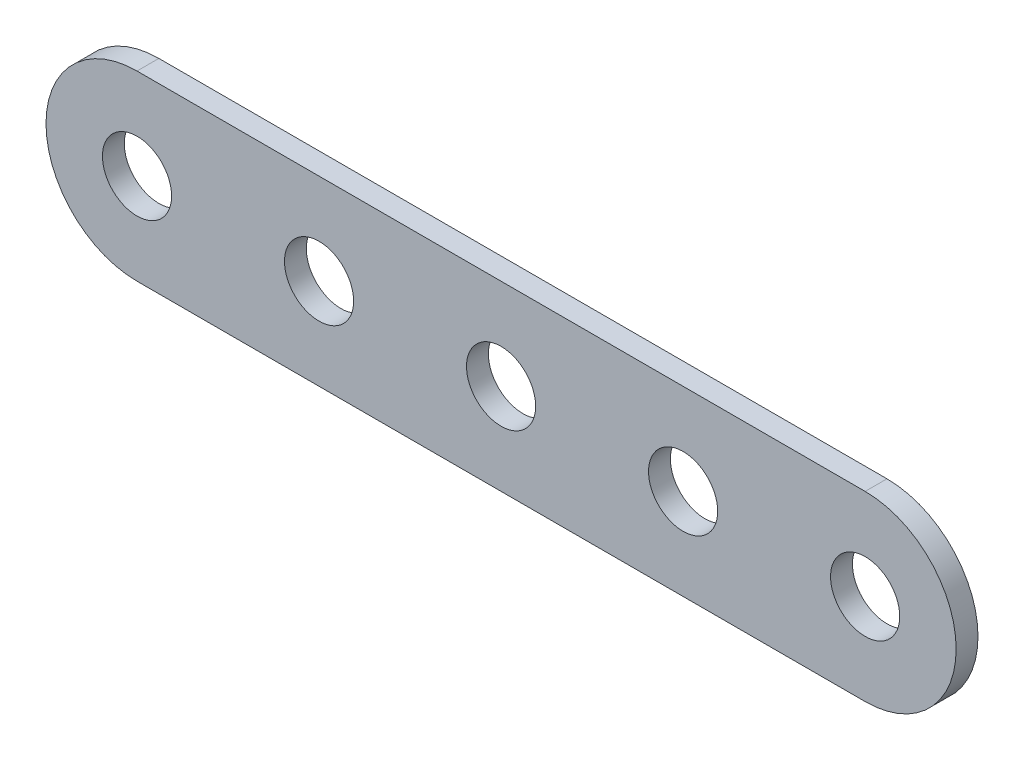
ISO-10303-21;
HEADER;
FILE_DESCRIPTION(('STEP AP214'),'2;1');
FILE_NAME('part.step','',(''),(''),'','','');
FILE_SCHEMA(('AUTOMOTIVE_DESIGN { 1 0 10303 214 1 1 1 1 }'));
ENDSEC;
DATA;
#1=APPLICATION_CONTEXT('core data for automotive mechanical design processes');
#2=APPLICATION_PROTOCOL_DEFINITION('international standard','automotive_design',2000,#1);
#3=PRODUCT_CONTEXT('',#1,'mechanical');
#4=PRODUCT('Part','Part','',(#3));
#5=PRODUCT_RELATED_PRODUCT_CATEGORY('part','',(#4));
#6=PRODUCT_DEFINITION_FORMATION('','',#4);
#7=PRODUCT_DEFINITION_CONTEXT('part definition',#1,'design');
#8=PRODUCT_DEFINITION('design','',#6,#7);
#9=PRODUCT_DEFINITION_SHAPE('','',#8);
#10=(LENGTH_UNIT() NAMED_UNIT(*) SI_UNIT(.MILLI.,.METRE.));
#11=(NAMED_UNIT(*) PLANE_ANGLE_UNIT() SI_UNIT($,.RADIAN.));
#12=(NAMED_UNIT(*) SI_UNIT($,.STERADIAN.) SOLID_ANGLE_UNIT());
#13=UNCERTAINTY_MEASURE_WITH_UNIT(LENGTH_MEASURE(1.E-05),#10,'distance_accuracy_value','');
#14=(GEOMETRIC_REPRESENTATION_CONTEXT(3) GLOBAL_UNCERTAINTY_ASSIGNED_CONTEXT((#13)) GLOBAL_UNIT_ASSIGNED_CONTEXT((#10,
#11,#12)) REPRESENTATION_CONTEXT('',''));
#15=CARTESIAN_POINT('',(0.,0.,0.));
#16=DIRECTION('',(0.,0.,1.));
#17=DIRECTION('',(1.,0.,0.));
#18=AXIS2_PLACEMENT_3D('',#15,#16,#17);
#19=CARTESIAN_POINT('',(-25.4,0.,1.524));
#20=DIRECTION('',(0.,0.,-1.));
#21=DIRECTION('',(-1.,0.,0.));
#22=AXIS2_PLACEMENT_3D('',#19,#20,#21);
#23=CYLINDRICAL_SURFACE('',#22,6.35);
#24=CARTESIAN_POINT('',(-25.4,0.,0.));
#25=DIRECTION('',(0.,0.,1.));
#26=DIRECTION('',(1.,0.,0.));
#27=AXIS2_PLACEMENT_3D('',#24,#25,#26);
#28=CIRCLE('',#27,6.35);
#29=CARTESIAN_POINT('',(-25.4,6.35,0.));
#30=VERTEX_POINT('',#29);
#31=CARTESIAN_POINT('',(-25.4,-6.35,0.));
#32=VERTEX_POINT('',#31);
#33=EDGE_CURVE('E101',#30,#32,#28,.T.);
#34=ORIENTED_EDGE('',*,*,#33,.T.);
#35=DIRECTION('',(0.,0.,-1.));
#36=VECTOR('',#35,1.);
#37=CARTESIAN_POINT('',(-25.4,-6.35,1.524));
#38=LINE('',#37,#36);
#39=CARTESIAN_POINT('',(-25.4,-6.35,1.524));
#40=VERTEX_POINT('',#39);
#41=EDGE_CURVE('E11',#40,#32,#38,.T.);
#42=ORIENTED_EDGE('',*,*,#41,.F.);
#43=CARTESIAN_POINT('',(-25.4,0.,1.524));
#44=DIRECTION('',(0.,0.,1.));
#45=DIRECTION('',(1.,0.,0.));
#46=AXIS2_PLACEMENT_3D('',#43,#44,#45);
#47=CIRCLE('',#46,6.35);
#48=CARTESIAN_POINT('',(-25.4,6.35,1.524));
#49=VERTEX_POINT('',#48);
#50=EDGE_CURVE('E89',#49,#40,#47,.T.);
#51=ORIENTED_EDGE('',*,*,#50,.F.);
#52=DIRECTION('',(0.,0.,-1.));
#53=VECTOR('',#52,1.);
#54=CARTESIAN_POINT('',(-25.4,6.35,1.524));
#55=LINE('',#54,#53);
#56=EDGE_CURVE('E97',#49,#30,#55,.T.);
#57=ORIENTED_EDGE('',*,*,#56,.T.);
#58=EDGE_LOOP('',(#34,#42,#51,#57));
#59=FACE_BOUND('',#58,.T.);
#60=ADVANCED_FACE('F38',(#59),#23,.T.);
#61=CARTESIAN_POINT('',(-25.4,-6.35,1.524));
#62=DIRECTION('',(0.,1.,0.));
#63=DIRECTION('',(0.,0.,1.));
#64=AXIS2_PLACEMENT_3D('',#61,#62,#63);
#65=PLANE('',#64);
#66=DIRECTION('',(1.,0.,0.));
#67=VECTOR('',#66,1.);
#68=CARTESIAN_POINT('',(-25.4,-6.35,0.));
#69=LINE('',#68,#67);
#70=CARTESIAN_POINT('',(25.4,-6.35,0.));
#71=VERTEX_POINT('',#70);
#72=EDGE_CURVE('E93',#32,#71,#69,.T.);
#73=ORIENTED_EDGE('',*,*,#72,.T.);
#74=DIRECTION('',(0.,0.,-1.));
#75=VECTOR('',#74,1.);
#76=CARTESIAN_POINT('',(25.4,-6.35,1.524));
#77=LINE('',#76,#75);
#78=CARTESIAN_POINT('',(25.4,-6.35,1.524));
#79=VERTEX_POINT('',#78);
#80=EDGE_CURVE('E46',#79,#71,#77,.T.);
#81=ORIENTED_EDGE('',*,*,#80,.F.);
#82=DIRECTION('',(1.,0.,0.));
#83=VECTOR('',#82,1.);
#84=CARTESIAN_POINT('',(-25.4,-6.35,1.524));
#85=LINE('',#84,#83);
#86=EDGE_CURVE('E84',#40,#79,#85,.T.);
#87=ORIENTED_EDGE('',*,*,#86,.F.);
#88=ORIENTED_EDGE('',*,*,#41,.T.);
#89=EDGE_LOOP('',(#73,#81,#87,#88));
#90=FACE_BOUND('',#89,.T.);
#91=ADVANCED_FACE('F92',(#90),#65,.F.);
#92=CARTESIAN_POINT('',(25.4,0.,1.524));
#93=DIRECTION('',(0.,0.,-1.));
#94=DIRECTION('',(-1.,0.,0.));
#95=AXIS2_PLACEMENT_3D('',#92,#93,#94);
#96=CYLINDRICAL_SURFACE('',#95,6.35);
#97=CARTESIAN_POINT('',(25.4,0.,0.));
#98=DIRECTION('',(0.,0.,1.));
#99=DIRECTION('',(-1.,0.,0.));
#100=AXIS2_PLACEMENT_3D('',#97,#98,#99);
#101=CIRCLE('',#100,6.35);
#102=CARTESIAN_POINT('',(25.4,6.35,0.));
#103=VERTEX_POINT('',#102);
#104=EDGE_CURVE('E71',#71,#103,#101,.T.);
#105=ORIENTED_EDGE('',*,*,#104,.T.);
#106=DIRECTION('',(0.,0.,-1.));
#107=VECTOR('',#106,1.);
#108=CARTESIAN_POINT('',(25.4,6.35,1.524));
#109=LINE('',#108,#107);
#110=CARTESIAN_POINT('',(25.4,6.35,1.524));
#111=VERTEX_POINT('',#110);
#112=EDGE_CURVE('E94',#111,#103,#109,.T.);
#113=ORIENTED_EDGE('',*,*,#112,.F.);
#114=CARTESIAN_POINT('',(25.4,0.,1.524));
#115=DIRECTION('',(0.,0.,1.));
#116=DIRECTION('',(-1.,0.,0.));
#117=AXIS2_PLACEMENT_3D('',#114,#115,#116);
#118=CIRCLE('',#117,6.35);
#119=EDGE_CURVE('E87',#79,#111,#118,.T.);
#120=ORIENTED_EDGE('',*,*,#119,.F.);
#121=ORIENTED_EDGE('',*,*,#80,.T.);
#122=EDGE_LOOP('',(#105,#113,#120,#121));
#123=FACE_BOUND('',#122,.T.);
#124=ADVANCED_FACE('F95',(#123),#96,.T.);
#125=CARTESIAN_POINT('',(-25.4,6.35,1.524));
#126=DIRECTION('',(0.,-1.,0.));
#127=DIRECTION('',(0.,0.,-1.));
#128=AXIS2_PLACEMENT_3D('',#125,#126,#127);
#129=PLANE('',#128);
#130=DIRECTION('',(-1.,0.,0.));
#131=VECTOR('',#130,1.);
#132=CARTESIAN_POINT('',(-25.4,6.35,0.));
#133=LINE('',#132,#131);
#134=EDGE_CURVE('E77',#103,#30,#133,.T.);
#135=ORIENTED_EDGE('',*,*,#134,.T.);
#136=ORIENTED_EDGE('',*,*,#56,.F.);
#137=DIRECTION('',(-1.,0.,0.));
#138=VECTOR('',#137,1.);
#139=CARTESIAN_POINT('',(-25.4,6.35,1.524));
#140=LINE('',#139,#138);
#141=EDGE_CURVE('E54',#111,#49,#140,.T.);
#142=ORIENTED_EDGE('',*,*,#141,.F.);
#143=ORIENTED_EDGE('',*,*,#112,.T.);
#144=EDGE_LOOP('',(#135,#136,#142,#143));
#145=FACE_BOUND('',#144,.T.);
#146=ADVANCED_FACE('F109',(#145),#129,.F.);
#147=CARTESIAN_POINT('',(-25.4,0.,1.524));
#148=DIRECTION('',(0.,0.,1.));
#149=DIRECTION('',(1.,0.,0.));
#150=AXIS2_PLACEMENT_3D('',#147,#148,#149);
#151=PLANE('',#150);
#152=CARTESIAN_POINT('',(25.4,0.,1.524));
#153=DIRECTION('',(0.,0.,1.));
#154=DIRECTION('',(1.,0.,0.));
#155=AXIS2_PLACEMENT_3D('',#152,#153,#154);
#156=CIRCLE('',#155,2.41299999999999);
#157=CARTESIAN_POINT('',(27.813,0.,1.524));
#158=VERTEX_POINT('',#157);
#159=EDGE_CURVE('E138',#158,#158,#156,.T.);
#160=ORIENTED_EDGE('',*,*,#159,.F.);
#161=EDGE_LOOP('',(#160));
#162=FACE_BOUND('',#161,.T.);
#163=CARTESIAN_POINT('',(12.7,0.,1.524));
#164=DIRECTION('',(0.,0.,1.));
#165=DIRECTION('',(1.,0.,0.));
#166=AXIS2_PLACEMENT_3D('',#163,#164,#165);
#167=CIRCLE('',#166,2.41299999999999);
#168=CARTESIAN_POINT('',(15.113,0.,1.524));
#169=VERTEX_POINT('',#168);
#170=EDGE_CURVE('E132',#169,#169,#167,.T.);
#171=ORIENTED_EDGE('',*,*,#170,.F.);
#172=EDGE_LOOP('',(#171));
#173=FACE_BOUND('',#172,.T.);
#174=CARTESIAN_POINT('',(0.,0.,1.524));
#175=DIRECTION('',(0.,0.,1.));
#176=DIRECTION('',(1.,0.,0.));
#177=AXIS2_PLACEMENT_3D('',#174,#175,#176);
#178=CIRCLE('',#177,2.41299999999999);
#179=CARTESIAN_POINT('',(2.41299999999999,0.,1.524));
#180=VERTEX_POINT('',#179);
#181=EDGE_CURVE('E126',#180,#180,#178,.T.);
#182=ORIENTED_EDGE('',*,*,#181,.F.);
#183=EDGE_LOOP('',(#182));
#184=FACE_BOUND('',#183,.T.);
#185=CARTESIAN_POINT('',(-12.7,0.,1.524));
#186=DIRECTION('',(0.,0.,1.));
#187=DIRECTION('',(1.,0.,0.));
#188=AXIS2_PLACEMENT_3D('',#185,#186,#187);
#189=CIRCLE('',#188,2.41299999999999);
#190=CARTESIAN_POINT('',(-10.287,0.,1.524));
#191=VERTEX_POINT('',#190);
#192=EDGE_CURVE('E118',#191,#191,#189,.T.);
#193=ORIENTED_EDGE('',*,*,#192,.F.);
#194=EDGE_LOOP('',(#193));
#195=FACE_BOUND('',#194,.T.);
#196=CARTESIAN_POINT('',(-25.4,0.,1.524));
#197=DIRECTION('',(0.,0.,1.));
#198=DIRECTION('',(1.,0.,0.));
#199=AXIS2_PLACEMENT_3D('',#196,#197,#198);
#200=CIRCLE('',#199,2.41299999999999);
#201=CARTESIAN_POINT('',(-22.987,0.,1.524));
#202=VERTEX_POINT('',#201);
#203=EDGE_CURVE('E115',#202,#202,#200,.T.);
#204=ORIENTED_EDGE('',*,*,#203,.F.);
#205=EDGE_LOOP('',(#204));
#206=FACE_BOUND('',#205,.T.);
#207=ORIENTED_EDGE('',*,*,#50,.T.);
#208=ORIENTED_EDGE('',*,*,#86,.T.);
#209=ORIENTED_EDGE('',*,*,#119,.T.);
#210=ORIENTED_EDGE('',*,*,#141,.T.);
#211=EDGE_LOOP('',(#207,#208,#209,#210));
#212=FACE_BOUND('',#211,.T.);
#213=ADVANCED_FACE('F85',(#162,#173,#184,#195,#206,#212),#151,.T.);
#214=CARTESIAN_POINT('',(-25.4,0.,0.));
#215=DIRECTION('',(0.,0.,1.));
#216=DIRECTION('',(1.,0.,0.));
#217=AXIS2_PLACEMENT_3D('',#214,#215,#216);
#218=PLANE('',#217);
#219=CARTESIAN_POINT('',(25.4,0.,0.));
#220=DIRECTION('',(0.,0.,1.));
#221=DIRECTION('',(1.,0.,0.));
#222=AXIS2_PLACEMENT_3D('',#219,#220,#221);
#223=CIRCLE('',#222,2.41299999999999);
#224=CARTESIAN_POINT('',(27.813,0.,0.));
#225=VERTEX_POINT('',#224);
#226=EDGE_CURVE('E141',#225,#225,#223,.T.);
#227=ORIENTED_EDGE('',*,*,#226,.T.);
#228=EDGE_LOOP('',(#227));
#229=FACE_BOUND('',#228,.T.);
#230=CARTESIAN_POINT('',(12.7,0.,0.));
#231=DIRECTION('',(0.,0.,1.));
#232=DIRECTION('',(1.,0.,0.));
#233=AXIS2_PLACEMENT_3D('',#230,#231,#232);
#234=CIRCLE('',#233,2.41299999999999);
#235=CARTESIAN_POINT('',(15.113,0.,0.));
#236=VERTEX_POINT('',#235);
#237=EDGE_CURVE('E135',#236,#236,#234,.T.);
#238=ORIENTED_EDGE('',*,*,#237,.T.);
#239=EDGE_LOOP('',(#238));
#240=FACE_BOUND('',#239,.T.);
#241=CARTESIAN_POINT('',(0.,0.,0.));
#242=DIRECTION('',(0.,0.,1.));
#243=DIRECTION('',(1.,0.,0.));
#244=AXIS2_PLACEMENT_3D('',#241,#242,#243);
#245=CIRCLE('',#244,2.41299999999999);
#246=CARTESIAN_POINT('',(2.41299999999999,0.,0.));
#247=VERTEX_POINT('',#246);
#248=EDGE_CURVE('E129',#247,#247,#245,.T.);
#249=ORIENTED_EDGE('',*,*,#248,.T.);
#250=EDGE_LOOP('',(#249));
#251=FACE_BOUND('',#250,.T.);
#252=CARTESIAN_POINT('',(-12.7,0.,0.));
#253=DIRECTION('',(0.,0.,1.));
#254=DIRECTION('',(1.,0.,0.));
#255=AXIS2_PLACEMENT_3D('',#252,#253,#254);
#256=CIRCLE('',#255,2.41299999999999);
#257=CARTESIAN_POINT('',(-10.287,0.,0.));
#258=VERTEX_POINT('',#257);
#259=EDGE_CURVE('E123',#258,#258,#256,.T.);
#260=ORIENTED_EDGE('',*,*,#259,.T.);
#261=EDGE_LOOP('',(#260));
#262=FACE_BOUND('',#261,.T.);
#263=CARTESIAN_POINT('',(-25.4,0.,0.));
#264=DIRECTION('',(0.,0.,1.));
#265=DIRECTION('',(1.,0.,0.));
#266=AXIS2_PLACEMENT_3D('',#263,#264,#265);
#267=CIRCLE('',#266,2.41299999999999);
#268=CARTESIAN_POINT('',(-22.987,0.,0.));
#269=VERTEX_POINT('',#268);
#270=EDGE_CURVE('E104',#269,#269,#267,.T.);
#271=ORIENTED_EDGE('',*,*,#270,.T.);
#272=EDGE_LOOP('',(#271));
#273=FACE_BOUND('',#272,.T.);
#274=ORIENTED_EDGE('',*,*,#33,.F.);
#275=ORIENTED_EDGE('',*,*,#134,.F.);
#276=ORIENTED_EDGE('',*,*,#104,.F.);
#277=ORIENTED_EDGE('',*,*,#72,.F.);
#278=EDGE_LOOP('',(#274,#275,#276,#277));
#279=FACE_BOUND('',#278,.T.);
#280=ADVANCED_FACE('F112',(#229,#240,#251,#262,#273,#279),#218,.F.);
#281=CARTESIAN_POINT('',(-25.4,0.,0.));
#282=DIRECTION('',(0.,0.,1.));
#283=DIRECTION('',(1.,0.,0.));
#284=AXIS2_PLACEMENT_3D('',#281,#282,#283);
#285=CYLINDRICAL_SURFACE('',#284,2.41299999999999);
#286=CARTESIAN_POINT('',(-22.987,0.,0.));
#287=CARTESIAN_POINT('',(-22.987,0.,0.015875));
#288=CARTESIAN_POINT('',(-22.987,0.,0.03175));
#289=CARTESIAN_POINT('',(-22.987,0.,0.0635));
#290=CARTESIAN_POINT('',(-22.987,0.,0.079375));
#291=CARTESIAN_POINT('',(-22.987,0.,0.111125));
#292=CARTESIAN_POINT('',(-22.987,0.,0.127));
#293=CARTESIAN_POINT('',(-22.987,0.,0.15875));
#294=CARTESIAN_POINT('',(-22.987,0.,0.174625));
#295=CARTESIAN_POINT('',(-22.987,0.,0.206375));
#296=CARTESIAN_POINT('',(-22.987,0.,0.22225));
#297=CARTESIAN_POINT('',(-22.987,0.,0.254));
#298=CARTESIAN_POINT('',(-22.987,0.,0.269875));
#299=CARTESIAN_POINT('',(-22.987,0.,0.301625));
#300=CARTESIAN_POINT('',(-22.987,0.,0.3175));
#301=CARTESIAN_POINT('',(-22.987,0.,0.34925));
#302=CARTESIAN_POINT('',(-22.987,0.,0.365125));
#303=CARTESIAN_POINT('',(-22.987,0.,0.396875));
#304=CARTESIAN_POINT('',(-22.987,0.,0.41275));
#305=CARTESIAN_POINT('',(-22.987,0.,0.4445));
#306=CARTESIAN_POINT('',(-22.987,0.,0.460375));
#307=CARTESIAN_POINT('',(-22.987,0.,0.492125));
#308=CARTESIAN_POINT('',(-22.987,0.,0.508));
#309=CARTESIAN_POINT('',(-22.987,0.,0.53975));
#310=CARTESIAN_POINT('',(-22.987,0.,0.555625));
#311=CARTESIAN_POINT('',(-22.987,0.,0.587375));
#312=CARTESIAN_POINT('',(-22.987,0.,0.60325));
#313=CARTESIAN_POINT('',(-22.987,0.,0.635));
#314=CARTESIAN_POINT('',(-22.987,0.,0.650875));
#315=CARTESIAN_POINT('',(-22.987,0.,0.682625));
#316=CARTESIAN_POINT('',(-22.987,0.,0.6985));
#317=CARTESIAN_POINT('',(-22.987,0.,0.73025));
#318=CARTESIAN_POINT('',(-22.987,0.,0.746125));
#319=CARTESIAN_POINT('',(-22.987,0.,0.777875));
#320=CARTESIAN_POINT('',(-22.987,0.,0.79375));
#321=CARTESIAN_POINT('',(-22.987,0.,0.8255));
#322=CARTESIAN_POINT('',(-22.987,0.,0.841375));
#323=CARTESIAN_POINT('',(-22.987,0.,0.873125));
#324=CARTESIAN_POINT('',(-22.987,0.,0.889));
#325=CARTESIAN_POINT('',(-22.987,0.,0.92075));
#326=CARTESIAN_POINT('',(-22.987,0.,0.936625));
#327=CARTESIAN_POINT('',(-22.987,0.,0.968375));
#328=CARTESIAN_POINT('',(-22.987,0.,0.98425));
#329=CARTESIAN_POINT('',(-22.987,0.,1.016));
#330=CARTESIAN_POINT('',(-22.987,0.,1.031875));
#331=CARTESIAN_POINT('',(-22.987,0.,1.063625));
#332=CARTESIAN_POINT('',(-22.987,0.,1.0795));
#333=CARTESIAN_POINT('',(-22.987,0.,1.11125));
#334=CARTESIAN_POINT('',(-22.987,0.,1.127125));
#335=CARTESIAN_POINT('',(-22.987,0.,1.158875));
#336=CARTESIAN_POINT('',(-22.987,0.,1.17475));
#337=CARTESIAN_POINT('',(-22.987,0.,1.2065));
#338=CARTESIAN_POINT('',(-22.987,0.,1.222375));
#339=CARTESIAN_POINT('',(-22.987,0.,1.254125));
#340=CARTESIAN_POINT('',(-22.987,0.,1.27));
#341=CARTESIAN_POINT('',(-22.987,0.,1.30175));
#342=CARTESIAN_POINT('',(-22.987,0.,1.317625));
#343=CARTESIAN_POINT('',(-22.987,0.,1.349375));
#344=CARTESIAN_POINT('',(-22.987,0.,1.36525));
#345=CARTESIAN_POINT('',(-22.987,0.,1.397));
#346=CARTESIAN_POINT('',(-22.987,0.,1.412875));
#347=CARTESIAN_POINT('',(-22.987,0.,1.444625));
#348=CARTESIAN_POINT('',(-22.987,0.,1.4605));
#349=CARTESIAN_POINT('',(-22.987,0.,1.49225));
#350=CARTESIAN_POINT('',(-22.987,0.,1.508125));
#351=CARTESIAN_POINT('',(-22.987,0.,1.524));
#352=B_SPLINE_CURVE_WITH_KNOTS('',3,(#286,#287,#288,#289,#290,#291,#292,#293,#294,#295,#296,
#297,#298,#299,#300,#301,#302,#303,#304,#305,#306,#307,#308,#309,#310,#311,#312,#313,#314,#315,
#316,#317,#318,#319,#320,#321,#322,#323,#324,#325,#326,#327,#328,#329,#330,#331,#332,#333,#334,
#335,#336,#337,#338,#339,#340,#341,#342,#343,#344,#345,#346,#347,#348,#349,#350,#351),
.UNSPECIFIED.,.F.,.F.,(4,2,2,2,2,2,2,2,2,2,2,2,2,2,2,2,2,2,2,2,2,2,2,2,2,2,2,2,2,2,2,2,4),(0.,
0.047625,0.09525,0.142875,0.1905,0.238125,0.28575,0.333375,0.381,0.428625,0.47625,0.523875,
0.5715,0.619125,0.66675,0.714375,0.762,0.809625,0.85725,0.904875,0.9525,1.000125,1.04775,
1.095375,1.143,1.190625,1.23825,1.285875,1.3335,1.381125,1.42875,1.476375,1.524),.UNSPECIFIED.);
#353=EDGE_CURVE('BSEAM165',#269,#202,#352,.T.);
#354=ORIENTED_EDGE('',*,*,#270,.F.);
#355=ORIENTED_EDGE('',*,*,#203,.T.);
#356=ORIENTED_EDGE('',*,*,#353,.T.);
#357=ORIENTED_EDGE('',*,*,#353,.F.);
#358=EDGE_LOOP('',(#354,#356,#355,#357));
#359=FACE_BOUND('',#358,.T.);
#360=ADVANCED_FACE('F165',(#359),#285,.F.);
#361=CARTESIAN_POINT('',(-12.7,0.,0.));
#362=DIRECTION('',(0.,0.,1.));
#363=DIRECTION('',(1.,0.,0.));
#364=AXIS2_PLACEMENT_3D('',#361,#362,#363);
#365=CYLINDRICAL_SURFACE('',#364,2.41299999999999);
#366=CARTESIAN_POINT('',(-10.287,0.,0.));
#367=CARTESIAN_POINT('',(-10.287,0.,0.015875));
#368=CARTESIAN_POINT('',(-10.287,0.,0.03175));
#369=CARTESIAN_POINT('',(-10.287,0.,0.0635));
#370=CARTESIAN_POINT('',(-10.287,0.,0.079375));
#371=CARTESIAN_POINT('',(-10.287,0.,0.111125));
#372=CARTESIAN_POINT('',(-10.287,0.,0.127));
#373=CARTESIAN_POINT('',(-10.287,0.,0.15875));
#374=CARTESIAN_POINT('',(-10.287,0.,0.174625));
#375=CARTESIAN_POINT('',(-10.287,0.,0.206375));
#376=CARTESIAN_POINT('',(-10.287,0.,0.22225));
#377=CARTESIAN_POINT('',(-10.287,0.,0.254));
#378=CARTESIAN_POINT('',(-10.287,0.,0.269875));
#379=CARTESIAN_POINT('',(-10.287,0.,0.301625));
#380=CARTESIAN_POINT('',(-10.287,0.,0.3175));
#381=CARTESIAN_POINT('',(-10.287,0.,0.34925));
#382=CARTESIAN_POINT('',(-10.287,0.,0.365125));
#383=CARTESIAN_POINT('',(-10.287,0.,0.396875));
#384=CARTESIAN_POINT('',(-10.287,0.,0.41275));
#385=CARTESIAN_POINT('',(-10.287,0.,0.4445));
#386=CARTESIAN_POINT('',(-10.287,0.,0.460375));
#387=CARTESIAN_POINT('',(-10.287,0.,0.492125));
#388=CARTESIAN_POINT('',(-10.287,0.,0.508));
#389=CARTESIAN_POINT('',(-10.287,0.,0.53975));
#390=CARTESIAN_POINT('',(-10.287,0.,0.555625));
#391=CARTESIAN_POINT('',(-10.287,0.,0.587375));
#392=CARTESIAN_POINT('',(-10.287,0.,0.60325));
#393=CARTESIAN_POINT('',(-10.287,0.,0.635));
#394=CARTESIAN_POINT('',(-10.287,0.,0.650875));
#395=CARTESIAN_POINT('',(-10.287,0.,0.682625));
#396=CARTESIAN_POINT('',(-10.287,0.,0.6985));
#397=CARTESIAN_POINT('',(-10.287,0.,0.73025));
#398=CARTESIAN_POINT('',(-10.287,0.,0.746125));
#399=CARTESIAN_POINT('',(-10.287,0.,0.777875));
#400=CARTESIAN_POINT('',(-10.287,0.,0.79375));
#401=CARTESIAN_POINT('',(-10.287,0.,0.8255));
#402=CARTESIAN_POINT('',(-10.287,0.,0.841375));
#403=CARTESIAN_POINT('',(-10.287,0.,0.873125));
#404=CARTESIAN_POINT('',(-10.287,0.,0.889));
#405=CARTESIAN_POINT('',(-10.287,0.,0.92075));
#406=CARTESIAN_POINT('',(-10.287,0.,0.936625));
#407=CARTESIAN_POINT('',(-10.287,0.,0.968375));
#408=CARTESIAN_POINT('',(-10.287,0.,0.98425));
#409=CARTESIAN_POINT('',(-10.287,0.,1.016));
#410=CARTESIAN_POINT('',(-10.287,0.,1.031875));
#411=CARTESIAN_POINT('',(-10.287,0.,1.063625));
#412=CARTESIAN_POINT('',(-10.287,0.,1.0795));
#413=CARTESIAN_POINT('',(-10.287,0.,1.11125));
#414=CARTESIAN_POINT('',(-10.287,0.,1.127125));
#415=CARTESIAN_POINT('',(-10.287,0.,1.158875));
#416=CARTESIAN_POINT('',(-10.287,0.,1.17475));
#417=CARTESIAN_POINT('',(-10.287,0.,1.2065));
#418=CARTESIAN_POINT('',(-10.287,0.,1.222375));
#419=CARTESIAN_POINT('',(-10.287,0.,1.254125));
#420=CARTESIAN_POINT('',(-10.287,0.,1.27));
#421=CARTESIAN_POINT('',(-10.287,0.,1.30175));
#422=CARTESIAN_POINT('',(-10.287,0.,1.317625));
#423=CARTESIAN_POINT('',(-10.287,0.,1.349375));
#424=CARTESIAN_POINT('',(-10.287,0.,1.36525));
#425=CARTESIAN_POINT('',(-10.287,0.,1.397));
#426=CARTESIAN_POINT('',(-10.287,0.,1.412875));
#427=CARTESIAN_POINT('',(-10.287,0.,1.444625));
#428=CARTESIAN_POINT('',(-10.287,0.,1.4605));
#429=CARTESIAN_POINT('',(-10.287,0.,1.49225));
#430=CARTESIAN_POINT('',(-10.287,0.,1.508125));
#431=CARTESIAN_POINT('',(-10.287,0.,1.524));
#432=B_SPLINE_CURVE_WITH_KNOTS('',3,(#366,#367,#368,#369,#370,#371,#372,#373,#374,#375,#376,
#377,#378,#379,#380,#381,#382,#383,#384,#385,#386,#387,#388,#389,#390,#391,#392,#393,#394,#395,
#396,#397,#398,#399,#400,#401,#402,#403,#404,#405,#406,#407,#408,#409,#410,#411,#412,#413,#414,
#415,#416,#417,#418,#419,#420,#421,#422,#423,#424,#425,#426,#427,#428,#429,#430,#431),
.UNSPECIFIED.,.F.,.F.,(4,2,2,2,2,2,2,2,2,2,2,2,2,2,2,2,2,2,2,2,2,2,2,2,2,2,2,2,2,2,2,2,4),(0.,
0.047625,0.09525,0.142875,0.1905,0.238125,0.28575,0.333375,0.381,0.428625,0.47625,0.523875,
0.5715,0.619125,0.66675,0.714375,0.762,0.809625,0.85725,0.904875,0.9525,1.000125,1.04775,
1.095375,1.143,1.190625,1.23825,1.285875,1.3335,1.381125,1.42875,1.476375,1.524),.UNSPECIFIED.);
#433=EDGE_CURVE('BSEAM167',#258,#191,#432,.T.);
#434=ORIENTED_EDGE('',*,*,#259,.F.);
#435=ORIENTED_EDGE('',*,*,#192,.T.);
#436=ORIENTED_EDGE('',*,*,#433,.T.);
#437=ORIENTED_EDGE('',*,*,#433,.F.);
#438=EDGE_LOOP('',(#434,#436,#435,#437));
#439=FACE_BOUND('',#438,.T.);
#440=ADVANCED_FACE('F167',(#439),#365,.F.);
#441=CARTESIAN_POINT('',(0.,0.,0.));
#442=DIRECTION('',(0.,0.,1.));
#443=DIRECTION('',(1.,0.,0.));
#444=AXIS2_PLACEMENT_3D('',#441,#442,#443);
#445=CYLINDRICAL_SURFACE('',#444,2.41299999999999);
#446=CARTESIAN_POINT('',(2.41299999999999,0.,0.));
#447=CARTESIAN_POINT('',(2.41299999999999,0.,0.015875));
#448=CARTESIAN_POINT('',(2.41299999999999,0.,0.03175));
#449=CARTESIAN_POINT('',(2.41299999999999,0.,0.0635));
#450=CARTESIAN_POINT('',(2.41299999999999,0.,0.079375));
#451=CARTESIAN_POINT('',(2.41299999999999,0.,0.111125));
#452=CARTESIAN_POINT('',(2.41299999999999,0.,0.127));
#453=CARTESIAN_POINT('',(2.41299999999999,0.,0.15875));
#454=CARTESIAN_POINT('',(2.41299999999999,0.,0.174625));
#455=CARTESIAN_POINT('',(2.41299999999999,0.,0.206375));
#456=CARTESIAN_POINT('',(2.41299999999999,0.,0.22225));
#457=CARTESIAN_POINT('',(2.41299999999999,0.,0.254));
#458=CARTESIAN_POINT('',(2.41299999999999,0.,0.269875));
#459=CARTESIAN_POINT('',(2.41299999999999,0.,0.301625));
#460=CARTESIAN_POINT('',(2.41299999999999,0.,0.3175));
#461=CARTESIAN_POINT('',(2.41299999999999,0.,0.34925));
#462=CARTESIAN_POINT('',(2.41299999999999,0.,0.365125));
#463=CARTESIAN_POINT('',(2.41299999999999,0.,0.396875));
#464=CARTESIAN_POINT('',(2.41299999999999,0.,0.41275));
#465=CARTESIAN_POINT('',(2.41299999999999,0.,0.4445));
#466=CARTESIAN_POINT('',(2.41299999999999,0.,0.460375));
#467=CARTESIAN_POINT('',(2.41299999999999,0.,0.492125));
#468=CARTESIAN_POINT('',(2.41299999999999,0.,0.508));
#469=CARTESIAN_POINT('',(2.41299999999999,0.,0.53975));
#470=CARTESIAN_POINT('',(2.41299999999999,0.,0.555625));
#471=CARTESIAN_POINT('',(2.41299999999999,0.,0.587375));
#472=CARTESIAN_POINT('',(2.41299999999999,0.,0.60325));
#473=CARTESIAN_POINT('',(2.41299999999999,0.,0.635));
#474=CARTESIAN_POINT('',(2.41299999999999,0.,0.650875));
#475=CARTESIAN_POINT('',(2.41299999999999,0.,0.682625));
#476=CARTESIAN_POINT('',(2.41299999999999,0.,0.6985));
#477=CARTESIAN_POINT('',(2.41299999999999,0.,0.73025));
#478=CARTESIAN_POINT('',(2.41299999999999,0.,0.746125));
#479=CARTESIAN_POINT('',(2.41299999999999,0.,0.777875));
#480=CARTESIAN_POINT('',(2.41299999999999,0.,0.79375));
#481=CARTESIAN_POINT('',(2.41299999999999,0.,0.8255));
#482=CARTESIAN_POINT('',(2.41299999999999,0.,0.841375));
#483=CARTESIAN_POINT('',(2.41299999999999,0.,0.873125));
#484=CARTESIAN_POINT('',(2.41299999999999,0.,0.889));
#485=CARTESIAN_POINT('',(2.41299999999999,0.,0.92075));
#486=CARTESIAN_POINT('',(2.41299999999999,0.,0.936625));
#487=CARTESIAN_POINT('',(2.41299999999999,0.,0.968375));
#488=CARTESIAN_POINT('',(2.41299999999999,0.,0.98425));
#489=CARTESIAN_POINT('',(2.41299999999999,0.,1.016));
#490=CARTESIAN_POINT('',(2.41299999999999,0.,1.031875));
#491=CARTESIAN_POINT('',(2.41299999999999,0.,1.063625));
#492=CARTESIAN_POINT('',(2.41299999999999,0.,1.0795));
#493=CARTESIAN_POINT('',(2.41299999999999,0.,1.11125));
#494=CARTESIAN_POINT('',(2.41299999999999,0.,1.127125));
#495=CARTESIAN_POINT('',(2.41299999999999,0.,1.158875));
#496=CARTESIAN_POINT('',(2.41299999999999,0.,1.17475));
#497=CARTESIAN_POINT('',(2.41299999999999,0.,1.2065));
#498=CARTESIAN_POINT('',(2.41299999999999,0.,1.222375));
#499=CARTESIAN_POINT('',(2.41299999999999,0.,1.254125));
#500=CARTESIAN_POINT('',(2.41299999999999,0.,1.27));
#501=CARTESIAN_POINT('',(2.41299999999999,0.,1.30175));
#502=CARTESIAN_POINT('',(2.41299999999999,0.,1.317625));
#503=CARTESIAN_POINT('',(2.41299999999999,0.,1.349375));
#504=CARTESIAN_POINT('',(2.41299999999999,0.,1.36525));
#505=CARTESIAN_POINT('',(2.41299999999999,0.,1.397));
#506=CARTESIAN_POINT('',(2.41299999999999,0.,1.412875));
#507=CARTESIAN_POINT('',(2.41299999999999,0.,1.444625));
#508=CARTESIAN_POINT('',(2.41299999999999,0.,1.4605));
#509=CARTESIAN_POINT('',(2.41299999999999,0.,1.49225));
#510=CARTESIAN_POINT('',(2.41299999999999,0.,1.508125));
#511=CARTESIAN_POINT('',(2.41299999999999,0.,1.524));
#512=B_SPLINE_CURVE_WITH_KNOTS('',3,(#446,#447,#448,#449,#450,#451,#452,#453,#454,#455,#456,
#457,#458,#459,#460,#461,#462,#463,#464,#465,#466,#467,#468,#469,#470,#471,#472,#473,#474,#475,
#476,#477,#478,#479,#480,#481,#482,#483,#484,#485,#486,#487,#488,#489,#490,#491,#492,#493,#494,
#495,#496,#497,#498,#499,#500,#501,#502,#503,#504,#505,#506,#507,#508,#509,#510,#511),
.UNSPECIFIED.,.F.,.F.,(4,2,2,2,2,2,2,2,2,2,2,2,2,2,2,2,2,2,2,2,2,2,2,2,2,2,2,2,2,2,2,2,4),(0.,
0.047625,0.09525,0.142875,0.1905,0.238125,0.28575,0.333375,0.381,0.428625,0.47625,0.523875,
0.5715,0.619125,0.66675,0.714375,0.762,0.809625,0.85725,0.904875,0.9525,1.000125,1.04775,
1.095375,1.143,1.190625,1.23825,1.285875,1.3335,1.381125,1.42875,1.476375,1.524),.UNSPECIFIED.);
#513=EDGE_CURVE('BSEAM174',#247,#180,#512,.T.);
#514=ORIENTED_EDGE('',*,*,#248,.F.);
#515=ORIENTED_EDGE('',*,*,#181,.T.);
#516=ORIENTED_EDGE('',*,*,#513,.T.);
#517=ORIENTED_EDGE('',*,*,#513,.F.);
#518=EDGE_LOOP('',(#514,#516,#515,#517));
#519=FACE_BOUND('',#518,.T.);
#520=ADVANCED_FACE('F174',(#519),#445,.F.);
#521=CARTESIAN_POINT('',(12.7,0.,0.));
#522=DIRECTION('',(0.,0.,1.));
#523=DIRECTION('',(1.,0.,0.));
#524=AXIS2_PLACEMENT_3D('',#521,#522,#523);
#525=CYLINDRICAL_SURFACE('',#524,2.41299999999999);
#526=CARTESIAN_POINT('',(15.113,0.,0.));
#527=CARTESIAN_POINT('',(15.113,0.,0.015875));
#528=CARTESIAN_POINT('',(15.113,0.,0.03175));
#529=CARTESIAN_POINT('',(15.113,0.,0.0635));
#530=CARTESIAN_POINT('',(15.113,0.,0.079375));
#531=CARTESIAN_POINT('',(15.113,0.,0.111125));
#532=CARTESIAN_POINT('',(15.113,0.,0.127));
#533=CARTESIAN_POINT('',(15.113,0.,0.15875));
#534=CARTESIAN_POINT('',(15.113,0.,0.174625));
#535=CARTESIAN_POINT('',(15.113,0.,0.206375));
#536=CARTESIAN_POINT('',(15.113,0.,0.22225));
#537=CARTESIAN_POINT('',(15.113,0.,0.254));
#538=CARTESIAN_POINT('',(15.113,0.,0.269875));
#539=CARTESIAN_POINT('',(15.113,0.,0.301625));
#540=CARTESIAN_POINT('',(15.113,0.,0.3175));
#541=CARTESIAN_POINT('',(15.113,0.,0.34925));
#542=CARTESIAN_POINT('',(15.113,0.,0.365125));
#543=CARTESIAN_POINT('',(15.113,0.,0.396875));
#544=CARTESIAN_POINT('',(15.113,0.,0.41275));
#545=CARTESIAN_POINT('',(15.113,0.,0.4445));
#546=CARTESIAN_POINT('',(15.113,0.,0.460375));
#547=CARTESIAN_POINT('',(15.113,0.,0.492125));
#548=CARTESIAN_POINT('',(15.113,0.,0.508));
#549=CARTESIAN_POINT('',(15.113,0.,0.53975));
#550=CARTESIAN_POINT('',(15.113,0.,0.555625));
#551=CARTESIAN_POINT('',(15.113,0.,0.587375));
#552=CARTESIAN_POINT('',(15.113,0.,0.60325));
#553=CARTESIAN_POINT('',(15.113,0.,0.635));
#554=CARTESIAN_POINT('',(15.113,0.,0.650875));
#555=CARTESIAN_POINT('',(15.113,0.,0.682625));
#556=CARTESIAN_POINT('',(15.113,0.,0.6985));
#557=CARTESIAN_POINT('',(15.113,0.,0.73025));
#558=CARTESIAN_POINT('',(15.113,0.,0.746125));
#559=CARTESIAN_POINT('',(15.113,0.,0.777875));
#560=CARTESIAN_POINT('',(15.113,0.,0.79375));
#561=CARTESIAN_POINT('',(15.113,0.,0.8255));
#562=CARTESIAN_POINT('',(15.113,0.,0.841375));
#563=CARTESIAN_POINT('',(15.113,0.,0.873125));
#564=CARTESIAN_POINT('',(15.113,0.,0.889));
#565=CARTESIAN_POINT('',(15.113,0.,0.92075));
#566=CARTESIAN_POINT('',(15.113,0.,0.936625));
#567=CARTESIAN_POINT('',(15.113,0.,0.968375));
#568=CARTESIAN_POINT('',(15.113,0.,0.98425));
#569=CARTESIAN_POINT('',(15.113,0.,1.016));
#570=CARTESIAN_POINT('',(15.113,0.,1.031875));
#571=CARTESIAN_POINT('',(15.113,0.,1.063625));
#572=CARTESIAN_POINT('',(15.113,0.,1.0795));
#573=CARTESIAN_POINT('',(15.113,0.,1.11125));
#574=CARTESIAN_POINT('',(15.113,0.,1.127125));
#575=CARTESIAN_POINT('',(15.113,0.,1.158875));
#576=CARTESIAN_POINT('',(15.113,0.,1.17475));
#577=CARTESIAN_POINT('',(15.113,0.,1.2065));
#578=CARTESIAN_POINT('',(15.113,0.,1.222375));
#579=CARTESIAN_POINT('',(15.113,0.,1.254125));
#580=CARTESIAN_POINT('',(15.113,0.,1.27));
#581=CARTESIAN_POINT('',(15.113,0.,1.30175));
#582=CARTESIAN_POINT('',(15.113,0.,1.317625));
#583=CARTESIAN_POINT('',(15.113,0.,1.349375));
#584=CARTESIAN_POINT('',(15.113,0.,1.36525));
#585=CARTESIAN_POINT('',(15.113,0.,1.397));
#586=CARTESIAN_POINT('',(15.113,0.,1.412875));
#587=CARTESIAN_POINT('',(15.113,0.,1.444625));
#588=CARTESIAN_POINT('',(15.113,0.,1.4605));
#589=CARTESIAN_POINT('',(15.113,0.,1.49225));
#590=CARTESIAN_POINT('',(15.113,0.,1.508125));
#591=CARTESIAN_POINT('',(15.113,0.,1.524));
#592=B_SPLINE_CURVE_WITH_KNOTS('',3,(#526,#527,#528,#529,#530,#531,#532,#533,#534,#535,#536,
#537,#538,#539,#540,#541,#542,#543,#544,#545,#546,#547,#548,#549,#550,#551,#552,#553,#554,#555,
#556,#557,#558,#559,#560,#561,#562,#563,#564,#565,#566,#567,#568,#569,#570,#571,#572,#573,#574,
#575,#576,#577,#578,#579,#580,#581,#582,#583,#584,#585,#586,#587,#588,#589,#590,#591),
.UNSPECIFIED.,.F.,.F.,(4,2,2,2,2,2,2,2,2,2,2,2,2,2,2,2,2,2,2,2,2,2,2,2,2,2,2,2,2,2,2,2,4),(0.,
0.047625,0.09525,0.142875,0.1905,0.238125,0.28575,0.333375,0.381,0.428625,0.47625,0.523875,
0.5715,0.619125,0.66675,0.714375,0.762,0.809625,0.85725,0.904875,0.9525,1.000125,1.04775,
1.095375,1.143,1.190625,1.23825,1.285875,1.3335,1.381125,1.42875,1.476375,1.524),.UNSPECIFIED.);
#593=EDGE_CURVE('BSEAM150',#236,#169,#592,.T.);
#594=ORIENTED_EDGE('',*,*,#237,.F.);
#595=ORIENTED_EDGE('',*,*,#170,.T.);
#596=ORIENTED_EDGE('',*,*,#593,.T.);
#597=ORIENTED_EDGE('',*,*,#593,.F.);
#598=EDGE_LOOP('',(#594,#596,#595,#597));
#599=FACE_BOUND('',#598,.T.);
#600=ADVANCED_FACE('F150',(#599),#525,.F.);
#601=CARTESIAN_POINT('',(25.4,0.,0.));
#602=DIRECTION('',(0.,0.,1.));
#603=DIRECTION('',(1.,0.,0.));
#604=AXIS2_PLACEMENT_3D('',#601,#602,#603);
#605=CYLINDRICAL_SURFACE('',#604,2.41299999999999);
#606=CARTESIAN_POINT('',(27.813,0.,0.));
#607=CARTESIAN_POINT('',(27.813,0.,0.015875));
#608=CARTESIAN_POINT('',(27.813,0.,0.03175));
#609=CARTESIAN_POINT('',(27.813,0.,0.0635));
#610=CARTESIAN_POINT('',(27.813,0.,0.079375));
#611=CARTESIAN_POINT('',(27.813,0.,0.111125));
#612=CARTESIAN_POINT('',(27.813,0.,0.127));
#613=CARTESIAN_POINT('',(27.813,0.,0.15875));
#614=CARTESIAN_POINT('',(27.813,0.,0.174625));
#615=CARTESIAN_POINT('',(27.813,0.,0.206375));
#616=CARTESIAN_POINT('',(27.813,0.,0.22225));
#617=CARTESIAN_POINT('',(27.813,0.,0.254));
#618=CARTESIAN_POINT('',(27.813,0.,0.269875));
#619=CARTESIAN_POINT('',(27.813,0.,0.301625));
#620=CARTESIAN_POINT('',(27.813,0.,0.3175));
#621=CARTESIAN_POINT('',(27.813,0.,0.34925));
#622=CARTESIAN_POINT('',(27.813,0.,0.365125));
#623=CARTESIAN_POINT('',(27.813,0.,0.396875));
#624=CARTESIAN_POINT('',(27.813,0.,0.41275));
#625=CARTESIAN_POINT('',(27.813,0.,0.4445));
#626=CARTESIAN_POINT('',(27.813,0.,0.460375));
#627=CARTESIAN_POINT('',(27.813,0.,0.492125));
#628=CARTESIAN_POINT('',(27.813,0.,0.508));
#629=CARTESIAN_POINT('',(27.813,0.,0.53975));
#630=CARTESIAN_POINT('',(27.813,0.,0.555625));
#631=CARTESIAN_POINT('',(27.813,0.,0.587375));
#632=CARTESIAN_POINT('',(27.813,0.,0.60325));
#633=CARTESIAN_POINT('',(27.813,0.,0.635));
#634=CARTESIAN_POINT('',(27.813,0.,0.650875));
#635=CARTESIAN_POINT('',(27.813,0.,0.682625));
#636=CARTESIAN_POINT('',(27.813,0.,0.6985));
#637=CARTESIAN_POINT('',(27.813,0.,0.73025));
#638=CARTESIAN_POINT('',(27.813,0.,0.746125));
#639=CARTESIAN_POINT('',(27.813,0.,0.777875));
#640=CARTESIAN_POINT('',(27.813,0.,0.79375));
#641=CARTESIAN_POINT('',(27.813,0.,0.8255));
#642=CARTESIAN_POINT('',(27.813,0.,0.841375));
#643=CARTESIAN_POINT('',(27.813,0.,0.873125));
#644=CARTESIAN_POINT('',(27.813,0.,0.889));
#645=CARTESIAN_POINT('',(27.813,0.,0.92075));
#646=CARTESIAN_POINT('',(27.813,0.,0.936625));
#647=CARTESIAN_POINT('',(27.813,0.,0.968375));
#648=CARTESIAN_POINT('',(27.813,0.,0.98425));
#649=CARTESIAN_POINT('',(27.813,0.,1.016));
#650=CARTESIAN_POINT('',(27.813,0.,1.031875));
#651=CARTESIAN_POINT('',(27.813,0.,1.063625));
#652=CARTESIAN_POINT('',(27.813,0.,1.0795));
#653=CARTESIAN_POINT('',(27.813,0.,1.11125));
#654=CARTESIAN_POINT('',(27.813,0.,1.127125));
#655=CARTESIAN_POINT('',(27.813,0.,1.158875));
#656=CARTESIAN_POINT('',(27.813,0.,1.17475));
#657=CARTESIAN_POINT('',(27.813,0.,1.2065));
#658=CARTESIAN_POINT('',(27.813,0.,1.222375));
#659=CARTESIAN_POINT('',(27.813,0.,1.254125));
#660=CARTESIAN_POINT('',(27.813,0.,1.27));
#661=CARTESIAN_POINT('',(27.813,0.,1.30175));
#662=CARTESIAN_POINT('',(27.813,0.,1.317625));
#663=CARTESIAN_POINT('',(27.813,0.,1.349375));
#664=CARTESIAN_POINT('',(27.813,0.,1.36525));
#665=CARTESIAN_POINT('',(27.813,0.,1.397));
#666=CARTESIAN_POINT('',(27.813,0.,1.412875));
#667=CARTESIAN_POINT('',(27.813,0.,1.444625));
#668=CARTESIAN_POINT('',(27.813,0.,1.4605));
#669=CARTESIAN_POINT('',(27.813,0.,1.49225));
#670=CARTESIAN_POINT('',(27.813,0.,1.508125));
#671=CARTESIAN_POINT('',(27.813,0.,1.524));
#672=B_SPLINE_CURVE_WITH_KNOTS('',3,(#606,#607,#608,#609,#610,#611,#612,#613,#614,#615,#616,
#617,#618,#619,#620,#621,#622,#623,#624,#625,#626,#627,#628,#629,#630,#631,#632,#633,#634,#635,
#636,#637,#638,#639,#640,#641,#642,#643,#644,#645,#646,#647,#648,#649,#650,#651,#652,#653,#654,
#655,#656,#657,#658,#659,#660,#661,#662,#663,#664,#665,#666,#667,#668,#669,#670,#671),
.UNSPECIFIED.,.F.,.F.,(4,2,2,2,2,2,2,2,2,2,2,2,2,2,2,2,2,2,2,2,2,2,2,2,2,2,2,2,2,2,2,2,4),(0.,
0.047625,0.09525,0.142875,0.1905,0.238125,0.28575,0.333375,0.381,0.428625,0.47625,0.523875,
0.5715,0.619125,0.66675,0.714375,0.762,0.809625,0.85725,0.904875,0.9525,1.000125,1.04775,
1.095375,1.143,1.190625,1.23825,1.285875,1.3335,1.381125,1.42875,1.476375,1.524),.UNSPECIFIED.);
#673=EDGE_CURVE('BSEAM147',#225,#158,#672,.T.);
#674=ORIENTED_EDGE('',*,*,#226,.F.);
#675=ORIENTED_EDGE('',*,*,#159,.T.);
#676=ORIENTED_EDGE('',*,*,#673,.T.);
#677=ORIENTED_EDGE('',*,*,#673,.F.);
#678=EDGE_LOOP('',(#674,#676,#675,#677));
#679=FACE_BOUND('',#678,.T.);
#680=ADVANCED_FACE('F147',(#679),#605,.F.);
#681=CLOSED_SHELL('',(#60,#91,#124,#146,#213,#280,#360,#440,#520,#600,#680));
#682=MANIFOLD_SOLID_BREP('B2',#681);
#683=ADVANCED_BREP_SHAPE_REPRESENTATION('',(#18,#682),#14);
#684=SHAPE_DEFINITION_REPRESENTATION(#9,#683);
ENDSEC;
END-ISO-10303-21;
